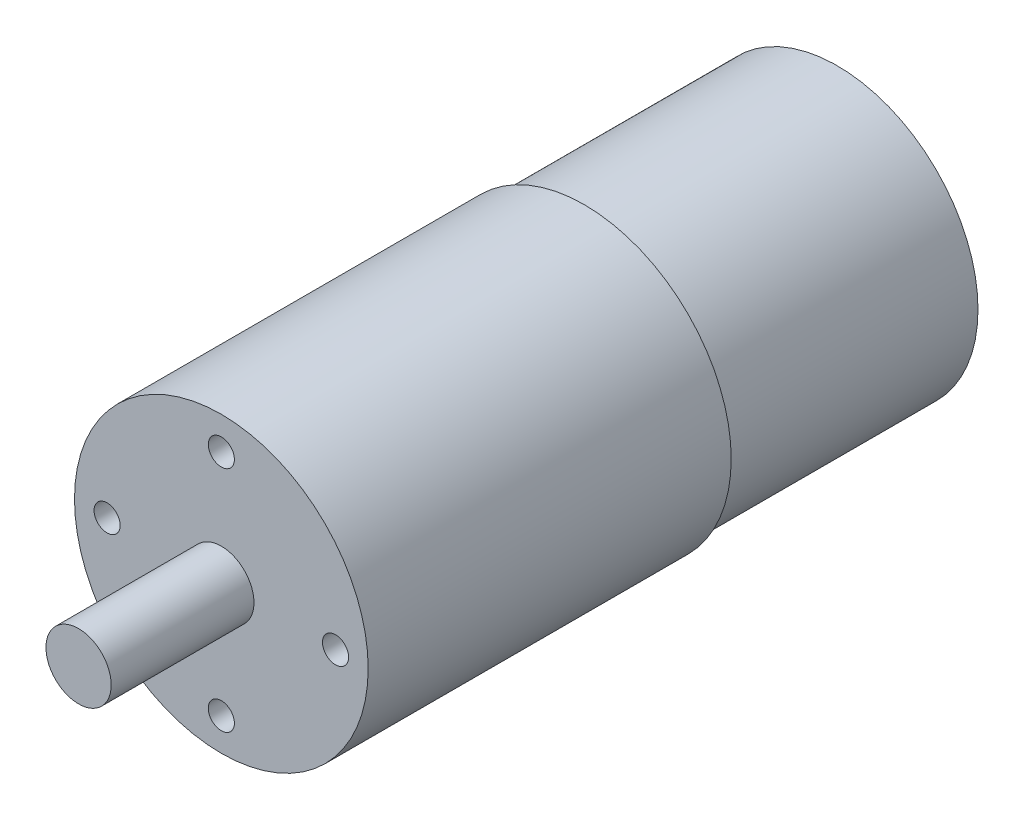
ISO-10303-21;
HEADER;
FILE_DESCRIPTION(('STEP AP214'),'2;1');
FILE_NAME('part.step','',(''),(''),'','','');
FILE_SCHEMA(('AUTOMOTIVE_DESIGN { 1 0 10303 214 1 1 1 1 }'));
ENDSEC;
DATA;
#1=APPLICATION_CONTEXT('core data for automotive mechanical design processes');
#2=APPLICATION_PROTOCOL_DEFINITION('international standard','automotive_design',2000,#1);
#3=PRODUCT_CONTEXT('',#1,'mechanical');
#4=PRODUCT('Part','Part','',(#3));
#5=PRODUCT_RELATED_PRODUCT_CATEGORY('part','',(#4));
#6=PRODUCT_DEFINITION_FORMATION('','',#4);
#7=PRODUCT_DEFINITION_CONTEXT('part definition',#1,'design');
#8=PRODUCT_DEFINITION('design','',#6,#7);
#9=PRODUCT_DEFINITION_SHAPE('','',#8);
#10=(LENGTH_UNIT() NAMED_UNIT(*) SI_UNIT(.MILLI.,.METRE.));
#11=(NAMED_UNIT(*) PLANE_ANGLE_UNIT() SI_UNIT($,.RADIAN.));
#12=(NAMED_UNIT(*) SI_UNIT($,.STERADIAN.) SOLID_ANGLE_UNIT());
#13=UNCERTAINTY_MEASURE_WITH_UNIT(LENGTH_MEASURE(1.E-05),#10,'distance_accuracy_value','');
#14=(GEOMETRIC_REPRESENTATION_CONTEXT(3) GLOBAL_UNCERTAINTY_ASSIGNED_CONTEXT((#13)) GLOBAL_UNIT_ASSIGNED_CONTEXT((#10,
#11,#12)) REPRESENTATION_CONTEXT('',''));
#15=CARTESIAN_POINT('',(0.,0.,0.));
#16=DIRECTION('',(0.,0.,1.));
#17=DIRECTION('',(1.,0.,0.));
#18=AXIS2_PLACEMENT_3D('',#15,#16,#17);
#19=CARTESIAN_POINT('',(0.,0.,0.));
#20=DIRECTION('',(0.,0.,1.));
#21=DIRECTION('',(1.,0.,0.));
#22=AXIS2_PLACEMENT_3D('',#19,#20,#21);
#23=PLANE('',#22);
#24=DIRECTION('',(0.,-1.,0.));
#25=VECTOR('',#24,1.);
#26=CARTESIAN_POINT('',(-11.,0.5,0.));
#27=LINE('',#26,#25);
#28=CARTESIAN_POINT('',(-11.,0.5,0.));
#29=VERTEX_POINT('',#28);
#30=CARTESIAN_POINT('',(-11.,-0.5,0.));
#31=VERTEX_POINT('',#30);
#32=EDGE_CURVE('E159',#29,#31,#27,.T.);
#33=ORIENTED_EDGE('',*,*,#32,.T.);
#34=DIRECTION('',(1.,0.,0.));
#35=VECTOR('',#34,1.);
#36=CARTESIAN_POINT('',(-11.,-0.5,0.));
#37=LINE('',#36,#35);
#38=CARTESIAN_POINT('',(-9.,-0.5,0.));
#39=VERTEX_POINT('',#38);
#40=EDGE_CURVE('E151',#31,#39,#37,.T.);
#41=ORIENTED_EDGE('',*,*,#40,.T.);
#42=DIRECTION('',(0.,-1.,0.));
#43=VECTOR('',#42,1.);
#44=CARTESIAN_POINT('',(-9.,0.5,0.));
#45=LINE('',#44,#43);
#46=CARTESIAN_POINT('',(-9.,0.5,0.));
#47=VERTEX_POINT('',#46);
#48=EDGE_CURVE('E156',#47,#39,#45,.T.);
#49=ORIENTED_EDGE('',*,*,#48,.F.);
#50=DIRECTION('',(1.,0.,0.));
#51=VECTOR('',#50,1.);
#52=CARTESIAN_POINT('',(-11.,0.5,0.));
#53=LINE('',#52,#51);
#54=EDGE_CURVE('E140',#29,#47,#53,.T.);
#55=ORIENTED_EDGE('',*,*,#54,.F.);
#56=EDGE_LOOP('',(#33,#41,#49,#55));
#57=FACE_BOUND('',#56,.T.);
#58=CARTESIAN_POINT('',(0.,0.,0.));
#59=DIRECTION('',(0.,0.,1.));
#60=DIRECTION('',(1.,0.,0.));
#61=AXIS2_PLACEMENT_3D('',#58,#59,#60);
#62=CIRCLE('',#61,17.25);
#63=CARTESIAN_POINT('',(17.25,0.,0.));
#64=VERTEX_POINT('',#63);
#65=EDGE_CURVE('E38',#64,#64,#62,.T.);
#66=ORIENTED_EDGE('',*,*,#65,.F.);
#67=EDGE_LOOP('',(#66));
#68=FACE_BOUND('',#67,.T.);
#69=DIRECTION('',(0.,-1.,0.));
#70=VECTOR('',#69,1.);
#71=CARTESIAN_POINT('',(9.,0.5,0.));
#72=LINE('',#71,#70);
#73=CARTESIAN_POINT('',(9.,0.5,0.));
#74=VERTEX_POINT('',#73);
#75=CARTESIAN_POINT('',(9.,-0.5,0.));
#76=VERTEX_POINT('',#75);
#77=EDGE_CURVE('E56',#74,#76,#72,.T.);
#78=ORIENTED_EDGE('',*,*,#77,.T.);
#79=DIRECTION('',(1.,0.,0.));
#80=VECTOR('',#79,1.);
#81=CARTESIAN_POINT('',(11.,-0.5,0.));
#82=LINE('',#81,#80);
#83=CARTESIAN_POINT('',(11.,-0.5,0.));
#84=VERTEX_POINT('',#83);
#85=EDGE_CURVE('E321',#76,#84,#82,.T.);
#86=ORIENTED_EDGE('',*,*,#85,.T.);
#87=DIRECTION('',(0.,-1.,0.));
#88=VECTOR('',#87,1.);
#89=CARTESIAN_POINT('',(11.,0.5,0.));
#90=LINE('',#89,#88);
#91=CARTESIAN_POINT('',(11.,0.5,0.));
#92=VERTEX_POINT('',#91);
#93=EDGE_CURVE('E126',#92,#84,#90,.T.);
#94=ORIENTED_EDGE('',*,*,#93,.F.);
#95=DIRECTION('',(1.,0.,0.));
#96=VECTOR('',#95,1.);
#97=CARTESIAN_POINT('',(11.,0.5,0.));
#98=LINE('',#97,#96);
#99=EDGE_CURVE('E51',#74,#92,#98,.T.);
#100=ORIENTED_EDGE('',*,*,#99,.F.);
#101=EDGE_LOOP('',(#78,#86,#94,#100));
#102=FACE_BOUND('',#101,.T.);
#103=ADVANCED_FACE('F34',(#57,#68,#102),#23,.F.);
#104=CARTESIAN_POINT('',(0.,0.,31.));
#105=DIRECTION('',(0.,0.,-1.));
#106=DIRECTION('',(-1.,0.,0.));
#107=AXIS2_PLACEMENT_3D('',#104,#105,#106);
#108=CYLINDRICAL_SURFACE('',#107,17.25);
#109=CARTESIAN_POINT('',(0.,0.,31.));
#110=DIRECTION('',(0.,0.,1.));
#111=DIRECTION('',(1.,0.,0.));
#112=AXIS2_PLACEMENT_3D('',#109,#110,#111);
#113=CIRCLE('',#112,17.25);
#114=CARTESIAN_POINT('',(17.25,0.,31.));
#115=VERTEX_POINT('',#114);
#116=EDGE_CURVE('E43',#115,#115,#113,.T.);
#117=ORIENTED_EDGE('',*,*,#116,.F.);
#118=EDGE_LOOP('',(#117));
#119=FACE_BOUND('',#118,.T.);
#120=ORIENTED_EDGE('',*,*,#65,.T.);
#121=EDGE_LOOP('',(#120));
#122=FACE_BOUND('',#121,.T.);
#123=ADVANCED_FACE('F36',(#119,#122),#108,.T.);
#124=CARTESIAN_POINT('',(0.,0.,75.5));
#125=DIRECTION('',(0.,0.,-1.));
#126=DIRECTION('',(-1.,0.,0.));
#127=AXIS2_PLACEMENT_3D('',#124,#125,#126);
#128=CYLINDRICAL_SURFACE('',#127,18.);
#129=CARTESIAN_POINT('',(0.,0.,75.5));
#130=DIRECTION('',(0.,0.,1.));
#131=DIRECTION('',(1.,0.,0.));
#132=AXIS2_PLACEMENT_3D('',#129,#130,#131);
#133=CIRCLE('',#132,18.);
#134=CARTESIAN_POINT('',(18.,0.,75.5));
#135=VERTEX_POINT('',#134);
#136=EDGE_CURVE('E192',#135,#135,#133,.T.);
#137=ORIENTED_EDGE('',*,*,#136,.F.);
#138=EDGE_LOOP('',(#137));
#139=FACE_BOUND('',#138,.T.);
#140=CARTESIAN_POINT('',(0.,0.,31.));
#141=DIRECTION('',(0.,0.,1.));
#142=DIRECTION('',(1.,0.,0.));
#143=AXIS2_PLACEMENT_3D('',#140,#141,#142);
#144=CIRCLE('',#143,18.);
#145=CARTESIAN_POINT('',(18.,0.,31.));
#146=VERTEX_POINT('',#145);
#147=EDGE_CURVE('E190',#146,#146,#144,.T.);
#148=ORIENTED_EDGE('',*,*,#147,.T.);
#149=EDGE_LOOP('',(#148));
#150=FACE_BOUND('',#149,.T.);
#151=ADVANCED_FACE('F208',(#139,#150),#128,.T.);
#152=CARTESIAN_POINT('',(0.,0.,75.5));
#153=DIRECTION('',(0.,0.,1.));
#154=DIRECTION('',(1.,0.,0.));
#155=AXIS2_PLACEMENT_3D('',#152,#153,#154);
#156=PLANE('',#155);
#157=CARTESIAN_POINT('',(0.,14.,75.5));
#158=DIRECTION('',(0.,0.,1.));
#159=DIRECTION('',(1.,0.,0.));
#160=AXIS2_PLACEMENT_3D('',#157,#158,#159);
#161=CIRCLE('',#160,1.6);
#162=CARTESIAN_POINT('',(1.6,14.,75.5));
#163=VERTEX_POINT('',#162);
#164=EDGE_CURVE('E169',#163,#163,#161,.T.);
#165=ORIENTED_EDGE('',*,*,#164,.F.);
#166=EDGE_LOOP('',(#165));
#167=FACE_BOUND('',#166,.T.);
#168=CARTESIAN_POINT('',(14.0000000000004,3.9618942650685E-13,75.5));
#169=DIRECTION('',(0.,0.,1.));
#170=DIRECTION('',(1.,0.,0.));
#171=AXIS2_PLACEMENT_3D('',#168,#169,#170);
#172=CIRCLE('',#171,1.60000000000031);
#173=CARTESIAN_POINT('',(15.6000000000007,3.9618942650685E-13,75.5));
#174=VERTEX_POINT('',#173);
#175=EDGE_CURVE('E175',#174,#174,#172,.T.);
#176=ORIENTED_EDGE('',*,*,#175,.F.);
#177=EDGE_LOOP('',(#176));
#178=FACE_BOUND('',#177,.T.);
#179=CARTESIAN_POINT('',(7.923788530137E-13,-14.,75.5));
#180=DIRECTION('',(0.,0.,1.));
#181=DIRECTION('',(1.,0.,0.));
#182=AXIS2_PLACEMENT_3D('',#179,#180,#181);
#183=CIRCLE('',#182,1.60000000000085);
#184=CARTESIAN_POINT('',(1.60000000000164,-14.,75.5));
#185=VERTEX_POINT('',#184);
#186=EDGE_CURVE('E181',#185,#185,#183,.T.);
#187=ORIENTED_EDGE('',*,*,#186,.F.);
#188=EDGE_LOOP('',(#187));
#189=FACE_BOUND('',#188,.T.);
#190=CARTESIAN_POINT('',(-13.9999999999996,-3.97903932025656E-13,75.5));
#191=DIRECTION('',(0.,0.,1.));
#192=DIRECTION('',(1.,0.,0.));
#193=AXIS2_PLACEMENT_3D('',#190,#191,#192);
#194=CIRCLE('',#193,1.60000000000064);
#195=CARTESIAN_POINT('',(-12.399999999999,-3.97903932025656E-13,75.5));
#196=VERTEX_POINT('',#195);
#197=EDGE_CURVE('E164',#196,#196,#194,.T.);
#198=ORIENTED_EDGE('',*,*,#197,.F.);
#199=EDGE_LOOP('',(#198));
#200=FACE_BOUND('',#199,.T.);
#201=CARTESIAN_POINT('',(0.,0.,75.5));
#202=DIRECTION('',(0.,0.,1.));
#203=DIRECTION('',(1.,0.,0.));
#204=AXIS2_PLACEMENT_3D('',#201,#202,#203);
#205=CIRCLE('',#204,4.);
#206=CARTESIAN_POINT('',(4.,0.,75.5));
#207=VERTEX_POINT('',#206);
#208=EDGE_CURVE('E11',#207,#207,#205,.T.);
#209=ORIENTED_EDGE('',*,*,#208,.F.);
#210=EDGE_LOOP('',(#209));
#211=FACE_BOUND('',#210,.T.);
#212=ORIENTED_EDGE('',*,*,#136,.T.);
#213=EDGE_LOOP('',(#212));
#214=FACE_BOUND('',#213,.T.);
#215=ADVANCED_FACE('F213',(#167,#178,#189,#200,#211,#214),#156,.T.);
#216=CARTESIAN_POINT('',(0.,0.,31.));
#217=DIRECTION('',(0.,0.,1.));
#218=DIRECTION('',(1.,0.,0.));
#219=AXIS2_PLACEMENT_3D('',#216,#217,#218);
#220=PLANE('',#219);
#221=ORIENTED_EDGE('',*,*,#116,.T.);
#222=EDGE_LOOP('',(#221));
#223=FACE_BOUND('',#222,.T.);
#224=ORIENTED_EDGE('',*,*,#147,.F.);
#225=EDGE_LOOP('',(#224));
#226=FACE_BOUND('',#225,.T.);
#227=ADVANCED_FACE('F215',(#223,#226),#220,.F.);
#228=CARTESIAN_POINT('',(0.,0.,93.));
#229=DIRECTION('',(0.,0.,-1.));
#230=DIRECTION('',(-1.,0.,0.));
#231=AXIS2_PLACEMENT_3D('',#228,#229,#230);
#232=CYLINDRICAL_SURFACE('',#231,4.);
#233=CARTESIAN_POINT('',(0.,0.,93.));
#234=DIRECTION('',(0.,0.,1.));
#235=DIRECTION('',(1.,0.,0.));
#236=AXIS2_PLACEMENT_3D('',#233,#234,#235);
#237=CIRCLE('',#236,4.);
#238=CARTESIAN_POINT('',(4.,0.,93.));
#239=VERTEX_POINT('',#238);
#240=EDGE_CURVE('E168',#239,#239,#237,.T.);
#241=ORIENTED_EDGE('',*,*,#240,.F.);
#242=EDGE_LOOP('',(#241));
#243=FACE_BOUND('',#242,.T.);
#244=ORIENTED_EDGE('',*,*,#208,.T.);
#245=EDGE_LOOP('',(#244));
#246=FACE_BOUND('',#245,.T.);
#247=ADVANCED_FACE('F218',(#243,#246),#232,.T.);
#248=CARTESIAN_POINT('',(0.,0.,93.));
#249=DIRECTION('',(0.,0.,1.));
#250=DIRECTION('',(1.,0.,0.));
#251=AXIS2_PLACEMENT_3D('',#248,#249,#250);
#252=PLANE('',#251);
#253=ORIENTED_EDGE('',*,*,#240,.T.);
#254=EDGE_LOOP('',(#253));
#255=FACE_BOUND('',#254,.T.);
#256=ADVANCED_FACE('F224',(#255),#252,.T.);
#257=CARTESIAN_POINT('',(-13.9999999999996,-3.97903932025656E-13,70.5));
#258=DIRECTION('',(0.,0.,1.));
#259=DIRECTION('',(1.,0.,0.));
#260=AXIS2_PLACEMENT_3D('',#257,#258,#259);
#261=CYLINDRICAL_SURFACE('',#260,1.60000000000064);
#262=CARTESIAN_POINT('',(-13.9999999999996,-3.97903932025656E-13,70.5));
#263=DIRECTION('',(0.,0.,1.));
#264=DIRECTION('',(1.,0.,0.));
#265=AXIS2_PLACEMENT_3D('',#262,#263,#264);
#266=CIRCLE('',#265,1.60000000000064);
#267=CARTESIAN_POINT('',(-12.399999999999,-3.97903932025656E-13,70.5));
#268=VERTEX_POINT('',#267);
#269=EDGE_CURVE('E184',#268,#268,#266,.T.);
#270=ORIENTED_EDGE('',*,*,#269,.F.);
#271=EDGE_LOOP('',(#270));
#272=FACE_BOUND('',#271,.T.);
#273=ORIENTED_EDGE('',*,*,#197,.T.);
#274=EDGE_LOOP('',(#273));
#275=FACE_BOUND('',#274,.T.);
#276=ADVANCED_FACE('F228',(#272,#275),#261,.F.);
#277=CARTESIAN_POINT('',(-13.9999999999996,-3.97903932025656E-13,70.5));
#278=DIRECTION('',(0.,0.,1.));
#279=DIRECTION('',(1.,0.,0.));
#280=AXIS2_PLACEMENT_3D('',#277,#278,#279);
#281=PLANE('',#280);
#282=ORIENTED_EDGE('',*,*,#269,.T.);
#283=EDGE_LOOP('',(#282));
#284=FACE_BOUND('',#283,.T.);
#285=ADVANCED_FACE('F232',(#284),#281,.T.);
#286=CARTESIAN_POINT('',(7.923788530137E-13,-14.,70.5));
#287=DIRECTION('',(0.,0.,1.));
#288=DIRECTION('',(1.,0.,0.));
#289=AXIS2_PLACEMENT_3D('',#286,#287,#288);
#290=CYLINDRICAL_SURFACE('',#289,1.60000000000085);
#291=CARTESIAN_POINT('',(7.923788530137E-13,-14.,70.5));
#292=DIRECTION('',(0.,0.,1.));
#293=DIRECTION('',(1.,0.,0.));
#294=AXIS2_PLACEMENT_3D('',#291,#292,#293);
#295=CIRCLE('',#294,1.60000000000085);
#296=CARTESIAN_POINT('',(1.60000000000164,-14.,70.5));
#297=VERTEX_POINT('',#296);
#298=EDGE_CURVE('E178',#297,#297,#295,.T.);
#299=ORIENTED_EDGE('',*,*,#298,.F.);
#300=EDGE_LOOP('',(#299));
#301=FACE_BOUND('',#300,.T.);
#302=ORIENTED_EDGE('',*,*,#186,.T.);
#303=EDGE_LOOP('',(#302));
#304=FACE_BOUND('',#303,.T.);
#305=ADVANCED_FACE('F236',(#301,#304),#290,.F.);
#306=CARTESIAN_POINT('',(7.923788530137E-13,-14.,70.5));
#307=DIRECTION('',(0.,0.,1.));
#308=DIRECTION('',(1.,0.,0.));
#309=AXIS2_PLACEMENT_3D('',#306,#307,#308);
#310=PLANE('',#309);
#311=ORIENTED_EDGE('',*,*,#298,.T.);
#312=EDGE_LOOP('',(#311));
#313=FACE_BOUND('',#312,.T.);
#314=ADVANCED_FACE('F240',(#313),#310,.T.);
#315=CARTESIAN_POINT('',(14.0000000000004,3.9618942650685E-13,70.5));
#316=DIRECTION('',(0.,0.,1.));
#317=DIRECTION('',(1.,0.,0.));
#318=AXIS2_PLACEMENT_3D('',#315,#316,#317);
#319=CYLINDRICAL_SURFACE('',#318,1.60000000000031);
#320=CARTESIAN_POINT('',(14.0000000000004,3.9618942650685E-13,70.5));
#321=DIRECTION('',(0.,0.,1.));
#322=DIRECTION('',(1.,0.,0.));
#323=AXIS2_PLACEMENT_3D('',#320,#321,#322);
#324=CIRCLE('',#323,1.60000000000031);
#325=CARTESIAN_POINT('',(15.6000000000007,3.9618942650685E-13,70.5));
#326=VERTEX_POINT('',#325);
#327=EDGE_CURVE('E172',#326,#326,#324,.T.);
#328=ORIENTED_EDGE('',*,*,#327,.F.);
#329=EDGE_LOOP('',(#328));
#330=FACE_BOUND('',#329,.T.);
#331=ORIENTED_EDGE('',*,*,#175,.T.);
#332=EDGE_LOOP('',(#331));
#333=FACE_BOUND('',#332,.T.);
#334=ADVANCED_FACE('F244',(#330,#333),#319,.F.);
#335=CARTESIAN_POINT('',(14.0000000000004,3.9618942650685E-13,70.5));
#336=DIRECTION('',(0.,0.,1.));
#337=DIRECTION('',(1.,0.,0.));
#338=AXIS2_PLACEMENT_3D('',#335,#336,#337);
#339=PLANE('',#338);
#340=ORIENTED_EDGE('',*,*,#327,.T.);
#341=EDGE_LOOP('',(#340));
#342=FACE_BOUND('',#341,.T.);
#343=ADVANCED_FACE('F248',(#342),#339,.T.);
#344=CARTESIAN_POINT('',(0.,14.,70.5));
#345=DIRECTION('',(0.,0.,1.));
#346=DIRECTION('',(1.,0.,0.));
#347=AXIS2_PLACEMENT_3D('',#344,#345,#346);
#348=CYLINDRICAL_SURFACE('',#347,1.6);
#349=CARTESIAN_POINT('',(0.,14.,70.5));
#350=DIRECTION('',(0.,0.,1.));
#351=DIRECTION('',(1.,0.,0.));
#352=AXIS2_PLACEMENT_3D('',#349,#350,#351);
#353=CIRCLE('',#352,1.6);
#354=CARTESIAN_POINT('',(1.6,14.,70.5));
#355=VERTEX_POINT('',#354);
#356=EDGE_CURVE('E165',#355,#355,#353,.T.);
#357=ORIENTED_EDGE('',*,*,#356,.F.);
#358=EDGE_LOOP('',(#357));
#359=FACE_BOUND('',#358,.T.);
#360=ORIENTED_EDGE('',*,*,#164,.T.);
#361=EDGE_LOOP('',(#360));
#362=FACE_BOUND('',#361,.T.);
#363=ADVANCED_FACE('F252',(#359,#362),#348,.F.);
#364=CARTESIAN_POINT('',(0.,14.,70.5));
#365=DIRECTION('',(0.,0.,1.));
#366=DIRECTION('',(1.,0.,0.));
#367=AXIS2_PLACEMENT_3D('',#364,#365,#366);
#368=PLANE('',#367);
#369=ORIENTED_EDGE('',*,*,#356,.T.);
#370=EDGE_LOOP('',(#369));
#371=FACE_BOUND('',#370,.T.);
#372=ADVANCED_FACE('F256',(#371),#368,.T.);
#373=CARTESIAN_POINT('',(-10.,0.5,-2.));
#374=DIRECTION('',(0.,1.,0.));
#375=DIRECTION('',(0.,0.,1.));
#376=AXIS2_PLACEMENT_3D('',#373,#374,#375);
#377=PLANE('',#376);
#378=CARTESIAN_POINT('',(-10.,0.5,-2.));
#379=DIRECTION('',(0.,1.,0.));
#380=DIRECTION('',(0.,0.,1.));
#381=AXIS2_PLACEMENT_3D('',#378,#379,#380);
#382=CIRCLE('',#381,1.);
#383=CARTESIAN_POINT('',(-9.,0.5,-2.));
#384=VERTEX_POINT('',#383);
#385=CARTESIAN_POINT('',(-11.,0.5,-2.));
#386=VERTEX_POINT('',#385);
#387=EDGE_CURVE('E133',#384,#386,#382,.T.);
#388=ORIENTED_EDGE('',*,*,#387,.T.);
#389=DIRECTION('',(0.,0.,1.));
#390=VECTOR('',#389,1.);
#391=CARTESIAN_POINT('',(-11.,0.5,-2.));
#392=LINE('',#391,#390);
#393=EDGE_CURVE('E136',#386,#29,#392,.T.);
#394=ORIENTED_EDGE('',*,*,#393,.T.);
#395=ORIENTED_EDGE('',*,*,#54,.T.);
#396=DIRECTION('',(0.,0.,-1.));
#397=VECTOR('',#396,1.);
#398=CARTESIAN_POINT('',(-9.,0.5,0.));
#399=LINE('',#398,#397);
#400=EDGE_CURVE('E143',#47,#384,#399,.T.);
#401=ORIENTED_EDGE('',*,*,#400,.T.);
#402=EDGE_LOOP('',(#388,#394,#395,#401));
#403=FACE_BOUND('',#402,.T.);
#404=CARTESIAN_POINT('',(-10.,0.5,-2.));
#405=DIRECTION('',(0.,1.,0.));
#406=DIRECTION('',(0.,0.,1.));
#407=AXIS2_PLACEMENT_3D('',#404,#405,#406);
#408=CIRCLE('',#407,0.75);
#409=CARTESIAN_POINT('',(-10.,0.5,-1.25));
#410=VERTEX_POINT('',#409);
#411=EDGE_CURVE('E124',#410,#410,#408,.T.);
#412=ORIENTED_EDGE('',*,*,#411,.F.);
#413=EDGE_LOOP('',(#412));
#414=FACE_BOUND('',#413,.T.);
#415=ADVANCED_FACE('F260',(#403,#414),#377,.T.);
#416=CARTESIAN_POINT('',(-10.,-0.5,-2.));
#417=DIRECTION('',(0.,1.,0.));
#418=DIRECTION('',(0.,0.,1.));
#419=AXIS2_PLACEMENT_3D('',#416,#417,#418);
#420=PLANE('',#419);
#421=CARTESIAN_POINT('',(-10.,-0.5,-2.));
#422=DIRECTION('',(0.,1.,0.));
#423=DIRECTION('',(0.,0.,1.));
#424=AXIS2_PLACEMENT_3D('',#421,#422,#423);
#425=CIRCLE('',#424,1.);
#426=CARTESIAN_POINT('',(-9.,-0.5,-2.));
#427=VERTEX_POINT('',#426);
#428=CARTESIAN_POINT('',(-11.,-0.5,-2.));
#429=VERTEX_POINT('',#428);
#430=EDGE_CURVE('E131',#427,#429,#425,.T.);
#431=ORIENTED_EDGE('',*,*,#430,.F.);
#432=DIRECTION('',(0.,0.,-1.));
#433=VECTOR('',#432,1.);
#434=CARTESIAN_POINT('',(-9.,-0.5,0.));
#435=LINE('',#434,#433);
#436=EDGE_CURVE('E137',#39,#427,#435,.T.);
#437=ORIENTED_EDGE('',*,*,#436,.F.);
#438=ORIENTED_EDGE('',*,*,#40,.F.);
#439=DIRECTION('',(0.,0.,1.));
#440=VECTOR('',#439,1.);
#441=CARTESIAN_POINT('',(-11.,-0.5,-2.));
#442=LINE('',#441,#440);
#443=EDGE_CURVE('E148',#429,#31,#442,.T.);
#444=ORIENTED_EDGE('',*,*,#443,.F.);
#445=EDGE_LOOP('',(#431,#437,#438,#444));
#446=FACE_BOUND('',#445,.T.);
#447=CARTESIAN_POINT('',(-10.,-0.5,-2.));
#448=DIRECTION('',(0.,1.,0.));
#449=DIRECTION('',(0.,0.,1.));
#450=AXIS2_PLACEMENT_3D('',#447,#448,#449);
#451=CIRCLE('',#450,0.75);
#452=CARTESIAN_POINT('',(-10.,-0.5,-1.25));
#453=VERTEX_POINT('',#452);
#454=EDGE_CURVE('E121',#453,#453,#451,.T.);
#455=ORIENTED_EDGE('',*,*,#454,.T.);
#456=EDGE_LOOP('',(#455));
#457=FACE_BOUND('',#456,.T.);
#458=ADVANCED_FACE('F266',(#446,#457),#420,.F.);
#459=CARTESIAN_POINT('',(-10.,0.5,-2.));
#460=DIRECTION('',(0.,-1.,0.));
#461=DIRECTION('',(0.,0.,-1.));
#462=AXIS2_PLACEMENT_3D('',#459,#460,#461);
#463=CYLINDRICAL_SURFACE('',#462,1.);
#464=ORIENTED_EDGE('',*,*,#430,.T.);
#465=DIRECTION('',(0.,-1.,0.));
#466=VECTOR('',#465,1.);
#467=CARTESIAN_POINT('',(-11.,0.5,-2.));
#468=LINE('',#467,#466);
#469=EDGE_CURVE('E161',#386,#429,#468,.T.);
#470=ORIENTED_EDGE('',*,*,#469,.F.);
#471=ORIENTED_EDGE('',*,*,#387,.F.);
#472=DIRECTION('',(0.,-1.,0.));
#473=VECTOR('',#472,1.);
#474=CARTESIAN_POINT('',(-9.,0.5,-2.));
#475=LINE('',#474,#473);
#476=EDGE_CURVE('E145',#384,#427,#475,.T.);
#477=ORIENTED_EDGE('',*,*,#476,.T.);
#478=EDGE_LOOP('',(#464,#470,#471,#477));
#479=FACE_BOUND('',#478,.T.);
#480=ADVANCED_FACE('F262',(#479),#463,.T.);
#481=CARTESIAN_POINT('',(-11.,0.5,-2.));
#482=DIRECTION('',(1.,0.,0.));
#483=DIRECTION('',(0.,0.,-1.));
#484=AXIS2_PLACEMENT_3D('',#481,#482,#483);
#485=PLANE('',#484);
#486=ORIENTED_EDGE('',*,*,#443,.T.);
#487=ORIENTED_EDGE('',*,*,#32,.F.);
#488=ORIENTED_EDGE('',*,*,#393,.F.);
#489=ORIENTED_EDGE('',*,*,#469,.T.);
#490=EDGE_LOOP('',(#486,#487,#488,#489));
#491=FACE_BOUND('',#490,.T.);
#492=ADVANCED_FACE('F265',(#491),#485,.F.);
#493=CARTESIAN_POINT('',(-9.,0.5,0.));
#494=DIRECTION('',(-1.,0.,0.));
#495=DIRECTION('',(0.,0.,1.));
#496=AXIS2_PLACEMENT_3D('',#493,#494,#495);
#497=PLANE('',#496);
#498=ORIENTED_EDGE('',*,*,#436,.T.);
#499=ORIENTED_EDGE('',*,*,#476,.F.);
#500=ORIENTED_EDGE('',*,*,#400,.F.);
#501=ORIENTED_EDGE('',*,*,#48,.T.);
#502=EDGE_LOOP('',(#498,#499,#500,#501));
#503=FACE_BOUND('',#502,.T.);
#504=ADVANCED_FACE('F270',(#503),#497,.F.);
#505=CARTESIAN_POINT('',(-10.,0.5,-2.));
#506=DIRECTION('',(0.,-1.,0.));
#507=DIRECTION('',(0.,0.,-1.));
#508=AXIS2_PLACEMENT_3D('',#505,#506,#507);
#509=CYLINDRICAL_SURFACE('',#508,0.75);
#510=ORIENTED_EDGE('',*,*,#411,.T.);
#511=EDGE_LOOP('',(#510));
#512=FACE_BOUND('',#511,.T.);
#513=ORIENTED_EDGE('',*,*,#454,.F.);
#514=EDGE_LOOP('',(#513));
#515=FACE_BOUND('',#514,.T.);
#516=ADVANCED_FACE('F274',(#512,#515),#509,.F.);
#517=CARTESIAN_POINT('',(10.,0.5,-2.));
#518=DIRECTION('',(0.,-1.,0.));
#519=DIRECTION('',(0.,0.,-1.));
#520=AXIS2_PLACEMENT_3D('',#517,#518,#519);
#521=PLANE('',#520);
#522=CARTESIAN_POINT('',(10.,0.5,-2.));
#523=DIRECTION('',(0.,1.,0.));
#524=DIRECTION('',(0.,0.,-1.));
#525=AXIS2_PLACEMENT_3D('',#522,#523,#524);
#526=CIRCLE('',#525,1.);
#527=CARTESIAN_POINT('',(11.,0.5,-2.));
#528=VERTEX_POINT('',#527);
#529=CARTESIAN_POINT('',(9.,0.5,-2.));
#530=VERTEX_POINT('',#529);
#531=EDGE_CURVE('E106',#528,#530,#526,.T.);
#532=ORIENTED_EDGE('',*,*,#531,.T.);
#533=DIRECTION('',(0.,0.,1.));
#534=VECTOR('',#533,1.);
#535=CARTESIAN_POINT('',(9.,0.5,0.));
#536=LINE('',#535,#534);
#537=EDGE_CURVE('E99',#530,#74,#536,.T.);
#538=ORIENTED_EDGE('',*,*,#537,.T.);
#539=ORIENTED_EDGE('',*,*,#99,.T.);
#540=DIRECTION('',(0.,0.,-1.));
#541=VECTOR('',#540,1.);
#542=CARTESIAN_POINT('',(11.,0.5,-2.));
#543=LINE('',#542,#541);
#544=EDGE_CURVE('E112',#92,#528,#543,.T.);
#545=ORIENTED_EDGE('',*,*,#544,.T.);
#546=EDGE_LOOP('',(#532,#538,#539,#545));
#547=FACE_BOUND('',#546,.T.);
#548=CARTESIAN_POINT('',(10.,0.5,-2.));
#549=DIRECTION('',(0.,1.,0.));
#550=DIRECTION('',(0.,0.,-1.));
#551=AXIS2_PLACEMENT_3D('',#548,#549,#550);
#552=CIRCLE('',#551,0.75);
#553=CARTESIAN_POINT('',(10.,0.5,-2.75));
#554=VERTEX_POINT('',#553);
#555=EDGE_CURVE('E307',#554,#554,#552,.T.);
#556=ORIENTED_EDGE('',*,*,#555,.F.);
#557=EDGE_LOOP('',(#556));
#558=FACE_BOUND('',#557,.T.);
#559=ADVANCED_FACE('F109',(#547,#558),#521,.F.);
#560=CARTESIAN_POINT('',(10.,-0.5,-2.));
#561=DIRECTION('',(0.,-1.,0.));
#562=DIRECTION('',(0.,0.,-1.));
#563=AXIS2_PLACEMENT_3D('',#560,#561,#562);
#564=PLANE('',#563);
#565=CARTESIAN_POINT('',(10.,-0.5,-2.));
#566=DIRECTION('',(0.,1.,0.));
#567=DIRECTION('',(0.,0.,-1.));
#568=AXIS2_PLACEMENT_3D('',#565,#566,#567);
#569=CIRCLE('',#568,1.);
#570=CARTESIAN_POINT('',(11.,-0.5,-2.));
#571=VERTEX_POINT('',#570);
#572=CARTESIAN_POINT('',(9.,-0.5,-2.));
#573=VERTEX_POINT('',#572);
#574=EDGE_CURVE('E120',#571,#573,#569,.T.);
#575=ORIENTED_EDGE('',*,*,#574,.F.);
#576=DIRECTION('',(0.,0.,-1.));
#577=VECTOR('',#576,1.);
#578=CARTESIAN_POINT('',(11.,-0.5,-2.));
#579=LINE('',#578,#577);
#580=EDGE_CURVE('E116',#84,#571,#579,.T.);
#581=ORIENTED_EDGE('',*,*,#580,.F.);
#582=ORIENTED_EDGE('',*,*,#85,.F.);
#583=DIRECTION('',(0.,0.,1.));
#584=VECTOR('',#583,1.);
#585=CARTESIAN_POINT('',(9.,-0.5,0.));
#586=LINE('',#585,#584);
#587=EDGE_CURVE('E319',#573,#76,#586,.T.);
#588=ORIENTED_EDGE('',*,*,#587,.F.);
#589=EDGE_LOOP('',(#575,#581,#582,#588));
#590=FACE_BOUND('',#589,.T.);
#591=CARTESIAN_POINT('',(10.,-0.5,-2.));
#592=DIRECTION('',(0.,1.,0.));
#593=DIRECTION('',(0.,0.,-1.));
#594=AXIS2_PLACEMENT_3D('',#591,#592,#593);
#595=CIRCLE('',#594,0.75);
#596=CARTESIAN_POINT('',(10.,-0.5,-2.75));
#597=VERTEX_POINT('',#596);
#598=EDGE_CURVE('E310',#597,#597,#595,.T.);
#599=ORIENTED_EDGE('',*,*,#598,.T.);
#600=EDGE_LOOP('',(#599));
#601=FACE_BOUND('',#600,.T.);
#602=ADVANCED_FACE('F287',(#590,#601),#564,.T.);
#603=CARTESIAN_POINT('',(10.,0.5,-2.));
#604=DIRECTION('',(0.,-1.,0.));
#605=DIRECTION('',(0.,0.,-1.));
#606=AXIS2_PLACEMENT_3D('',#603,#604,#605);
#607=CYLINDRICAL_SURFACE('',#606,1.);
#608=ORIENTED_EDGE('',*,*,#574,.T.);
#609=DIRECTION('',(0.,-1.,0.));
#610=VECTOR('',#609,1.);
#611=CARTESIAN_POINT('',(9.,0.5,-2.));
#612=LINE('',#611,#610);
#613=EDGE_CURVE('E103',#530,#573,#612,.T.);
#614=ORIENTED_EDGE('',*,*,#613,.F.);
#615=ORIENTED_EDGE('',*,*,#531,.F.);
#616=DIRECTION('',(0.,-1.,0.));
#617=VECTOR('',#616,1.);
#618=CARTESIAN_POINT('',(11.,0.5,-2.));
#619=LINE('',#618,#617);
#620=EDGE_CURVE('E317',#528,#571,#619,.T.);
#621=ORIENTED_EDGE('',*,*,#620,.T.);
#622=EDGE_LOOP('',(#608,#614,#615,#621));
#623=FACE_BOUND('',#622,.T.);
#624=ADVANCED_FACE('F118',(#623),#607,.T.);
#625=CARTESIAN_POINT('',(9.,0.5,0.));
#626=DIRECTION('',(1.,0.,0.));
#627=DIRECTION('',(0.,0.,-1.));
#628=AXIS2_PLACEMENT_3D('',#625,#626,#627);
#629=PLANE('',#628);
#630=ORIENTED_EDGE('',*,*,#587,.T.);
#631=ORIENTED_EDGE('',*,*,#77,.F.);
#632=ORIENTED_EDGE('',*,*,#537,.F.);
#633=ORIENTED_EDGE('',*,*,#613,.T.);
#634=EDGE_LOOP('',(#630,#631,#632,#633));
#635=FACE_BOUND('',#634,.T.);
#636=ADVANCED_FACE('F101',(#635),#629,.F.);
#637=CARTESIAN_POINT('',(11.,0.5,-2.));
#638=DIRECTION('',(-1.,0.,0.));
#639=DIRECTION('',(0.,0.,1.));
#640=AXIS2_PLACEMENT_3D('',#637,#638,#639);
#641=PLANE('',#640);
#642=ORIENTED_EDGE('',*,*,#580,.T.);
#643=ORIENTED_EDGE('',*,*,#620,.F.);
#644=ORIENTED_EDGE('',*,*,#544,.F.);
#645=ORIENTED_EDGE('',*,*,#93,.T.);
#646=EDGE_LOOP('',(#642,#643,#644,#645));
#647=FACE_BOUND('',#646,.T.);
#648=ADVANCED_FACE('F290',(#647),#641,.F.);
#649=CARTESIAN_POINT('',(10.,0.5,-2.));
#650=DIRECTION('',(0.,-1.,0.));
#651=DIRECTION('',(0.,0.,-1.));
#652=AXIS2_PLACEMENT_3D('',#649,#650,#651);
#653=CYLINDRICAL_SURFACE('',#652,0.75);
#654=ORIENTED_EDGE('',*,*,#555,.T.);
#655=EDGE_LOOP('',(#654));
#656=FACE_BOUND('',#655,.T.);
#657=ORIENTED_EDGE('',*,*,#598,.F.);
#658=EDGE_LOOP('',(#657));
#659=FACE_BOUND('',#658,.T.);
#660=ADVANCED_FACE('F293',(#656,#659),#653,.F.);
#661=CLOSED_SHELL('',(#103,#123,#151,#215,#227,#247,#256,#276,#285,#305,#314,#334,#343,#363,
#372,#415,#458,#480,#492,#504,#516,#559,#602,#624,#636,#648,#660));
#662=MANIFOLD_SOLID_BREP('B2',#661);
#663=ADVANCED_BREP_SHAPE_REPRESENTATION('',(#18,#662),#14);
#664=SHAPE_DEFINITION_REPRESENTATION(#9,#663);
ENDSEC;
END-ISO-10303-21;
